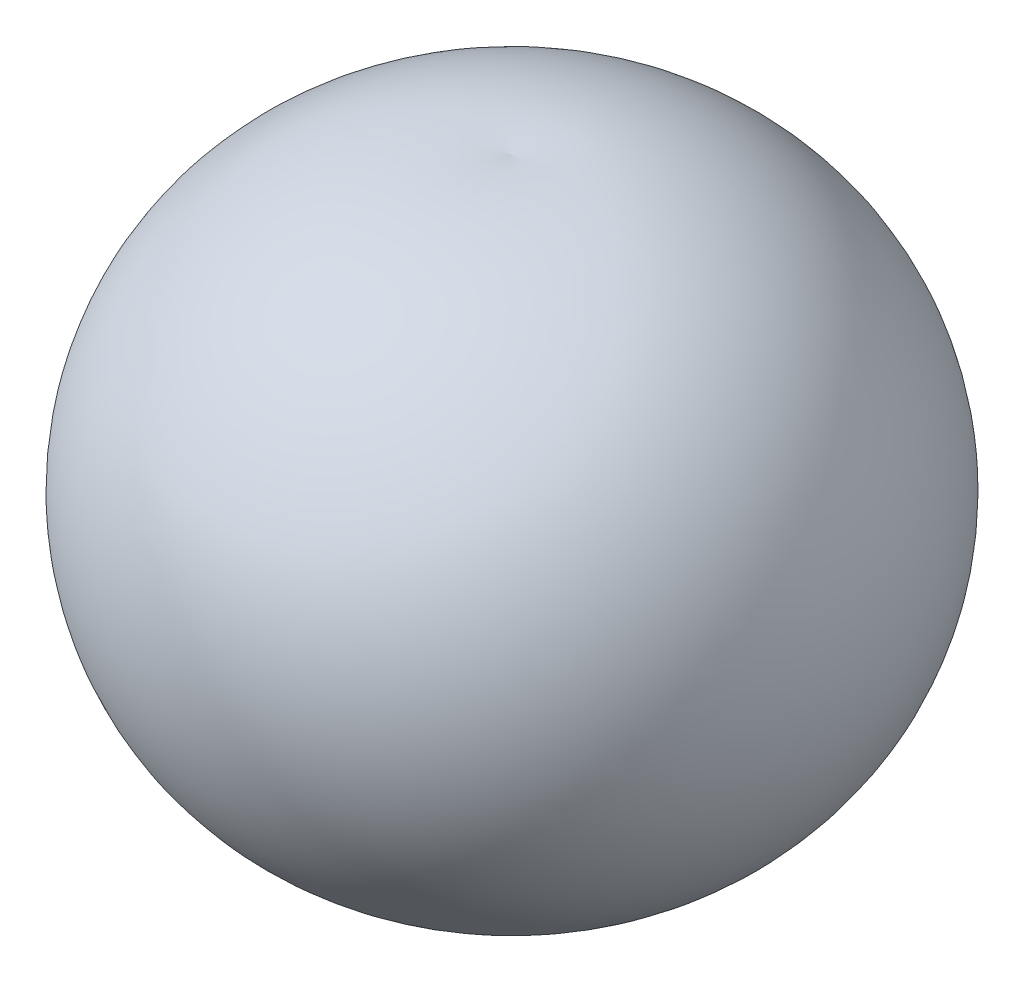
ISO-10303-21;
HEADER;
FILE_DESCRIPTION(('STEP AP214'),'2;1');
FILE_NAME('part.step','',(''),(''),'','','');
FILE_SCHEMA(('AUTOMOTIVE_DESIGN { 1 0 10303 214 1 1 1 1 }'));
ENDSEC;
DATA;
#1=APPLICATION_CONTEXT('core data for automotive mechanical design processes');
#2=APPLICATION_PROTOCOL_DEFINITION('international standard','automotive_design',2000,#1);
#3=PRODUCT_CONTEXT('',#1,'mechanical');
#4=PRODUCT('Part','Part','',(#3));
#5=PRODUCT_RELATED_PRODUCT_CATEGORY('part','',(#4));
#6=PRODUCT_DEFINITION_FORMATION('','',#4);
#7=PRODUCT_DEFINITION_CONTEXT('part definition',#1,'design');
#8=PRODUCT_DEFINITION('design','',#6,#7);
#9=PRODUCT_DEFINITION_SHAPE('','',#8);
#10=(LENGTH_UNIT() NAMED_UNIT(*) SI_UNIT(.MILLI.,.METRE.));
#11=(NAMED_UNIT(*) PLANE_ANGLE_UNIT() SI_UNIT($,.RADIAN.));
#12=(NAMED_UNIT(*) SI_UNIT($,.STERADIAN.) SOLID_ANGLE_UNIT());
#13=UNCERTAINTY_MEASURE_WITH_UNIT(LENGTH_MEASURE(1.E-05),#10,'distance_accuracy_value','');
#14=(GEOMETRIC_REPRESENTATION_CONTEXT(3) GLOBAL_UNCERTAINTY_ASSIGNED_CONTEXT((#13)) GLOBAL_UNIT_ASSIGNED_CONTEXT((#10,
#11,#12)) REPRESENTATION_CONTEXT('',''));
#15=CARTESIAN_POINT('',(0.,0.,0.));
#16=DIRECTION('',(0.,0.,1.));
#17=DIRECTION('',(1.,0.,0.));
#18=AXIS2_PLACEMENT_3D('',#15,#16,#17);
#19=CARTESIAN_POINT('',(0.,-216.604684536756,-525.511331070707));
#20=DIRECTION('',(-1.,0.,0.));
#21=DIRECTION('',(0.,0.,-1.));
#22=AXIS2_PLACEMENT_3D('',#19,#20,#21);
#23=CIRCLE('',#22,1054.7);
#24=TRIMMED_CURVE('',#23,(PARAMETER_VALUE(-2.09238326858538)),
(PARAMETER_VALUE(2.09238326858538)),.T.,.PARAMETER.);
#25=CARTESIAN_POINT('',(0.,-216.604684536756,0.));
#26=DIRECTION('',(0.,-1.,0.));
#27=AXIS1_PLACEMENT('',#25,#26);
#28=SURFACE_OF_REVOLUTION('',#24,#27);
#29=CARTESIAN_POINT('',(0.,-1172.48750752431,0.));
#30=DIRECTION('',(0.,-1.,0.));
#31=DIRECTION('',(0.,0.,-1.));
#32=AXIS2_PLACEMENT_3D('',#29,#30,#31);
#33=CIRCLE('',#32,971.246811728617);
#34=CARTESIAN_POINT('',(0.,-1172.48750752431,-971.246811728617));
#35=VERTEX_POINT('',#34);
#36=EDGE_CURVE('E43',#35,#35,#33,.T.);
#37=ORIENTED_EDGE('',*,*,#36,.T.);
#38=EDGE_LOOP('',(#37));
#39=FACE_BOUND('',#38,.T.);
#40=CARTESIAN_POINT('',(-4.44089209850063E-13,-1131.06076927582,0.));
#41=VERTEX_POINT('',#40);
#42=VERTEX_LOOP('',#41);
#43=FACE_BOUND('',#42,.T.);
#44=ADVANCED_FACE('F34',(#39,#43),#28,.T.);
#45=CARTESIAN_POINT('',(0.,445.,-217.));
#46=DIRECTION('',(-1.,0.,0.));
#47=DIRECTION('',(0.,0.,-1.));
#48=AXIS2_PLACEMENT_3D('',#45,#46,#47);
#49=CIRCLE('',#48,1784.7);
#50=TRIMMED_CURVE('',#49,(PARAMETER_VALUE(-1.69268699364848)),
(PARAMETER_VALUE(1.69268699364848)),.T.,.PARAMETER.);
#51=CARTESIAN_POINT('',(0.,445.,0.));
#52=DIRECTION('',(0.,-1.,0.));
#53=AXIS1_PLACEMENT('',#51,#52);
#54=SURFACE_OF_REVOLUTION('',#50,#53);
#55=CARTESIAN_POINT('',(0.,2216.4584640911,0.));
#56=VERTEX_POINT('',#55);
#57=VERTEX_LOOP('',#56);
#58=FACE_BOUND('',#57,.T.);
#59=ORIENTED_EDGE('',*,*,#36,.F.);
#60=EDGE_LOOP('',(#59));
#61=FACE_BOUND('',#60,.T.);
#62=ADVANCED_FACE('F70',(#58,#61),#54,.T.);
#63=CLOSED_SHELL('',(#44,#62));
#64=CARTESIAN_POINT('',(0.,381.376307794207,510.222129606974));
#65=DIRECTION('',(-1.,0.,0.));
#66=DIRECTION('',(0.,0.,-1.));
#67=AXIS2_PLACEMENT_3D('',#64,#65,#66);
#68=CIRCLE('',#67,1054.7);
#69=TRIMMED_CURVE('',#68,(PARAMETER_VALUE(-1.06585003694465)),
(PARAMETER_VALUE(1.06585003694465)),.T.,.PARAMETER.);
#70=CARTESIAN_POINT('',(0.,381.376307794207,0.));
#71=DIRECTION('',(0.,-1.,0.));
#72=AXIS1_PLACEMENT('',#70,#71);
#73=SURFACE_OF_REVOLUTION('',#69,#72);
#74=CARTESIAN_POINT('',(0.,796.590107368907,0.));
#75=DIRECTION('',(0.,-1.,0.));
#76=DIRECTION('',(0.,0.,-1.));
#77=AXIS2_PLACEMENT_3D('',#74,#75,#76);
#78=CIRCLE('',#77,459.308473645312);
#79=CARTESIAN_POINT('',(0.,796.590107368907,-459.308473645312));
#80=VERTEX_POINT('',#79);
#81=EDGE_CURVE('E11',#80,#80,#78,.T.);
#82=ORIENTED_EDGE('',*,*,#81,.T.);
#83=EDGE_LOOP('',(#82));
#84=FACE_BOUND('',#83,.T.);
#85=CARTESIAN_POINT('',(0.,1304.45023140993,0.));
#86=VERTEX_POINT('',#85);
#87=VERTEX_LOOP('',#86);
#88=FACE_BOUND('',#87,.T.);
#89=ADVANCED_FACE('F36',(#84,#88),#73,.F.);
#90=CARTESIAN_POINT('',(0.,445.,-217.));
#91=DIRECTION('',(-1.,0.,0.));
#92=DIRECTION('',(0.,0.,-1.));
#93=AXIS2_PLACEMENT_3D('',#90,#91,#92);
#94=CIRCLE('',#93,427.);
#95=TRIMMED_CURVE('',#94,(PARAMETER_VALUE(-2.10388600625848)),
(PARAMETER_VALUE(2.10388600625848)),.T.,.PARAMETER.);
#96=CARTESIAN_POINT('',(0.,445.,0.));
#97=DIRECTION('',(0.,-1.,0.));
#98=AXIS1_PLACEMENT('',#96,#97);
#99=SURFACE_OF_REVOLUTION('',#95,#98);
#100=CARTESIAN_POINT('',(0.,77.2500849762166,0.));
#101=VERTEX_POINT('',#100);
#102=VERTEX_LOOP('',#101);
#103=FACE_BOUND('',#102,.T.);
#104=ORIENTED_EDGE('',*,*,#81,.F.);
#105=EDGE_LOOP('',(#104));
#106=FACE_BOUND('',#105,.T.);
#107=ADVANCED_FACE('F56',(#103,#106),#99,.F.);
#108=CLOSED_SHELL('',(#89,#107));
#109=ORIENTED_CLOSED_SHELL('',*,#108,.T.);
#110=BREP_WITH_VOIDS('B2',#63,(#109));
#111=ADVANCED_BREP_SHAPE_REPRESENTATION('',(#18,#110),#14);
#112=SHAPE_DEFINITION_REPRESENTATION(#9,#111);
ENDSEC;
END-ISO-10303-21;
